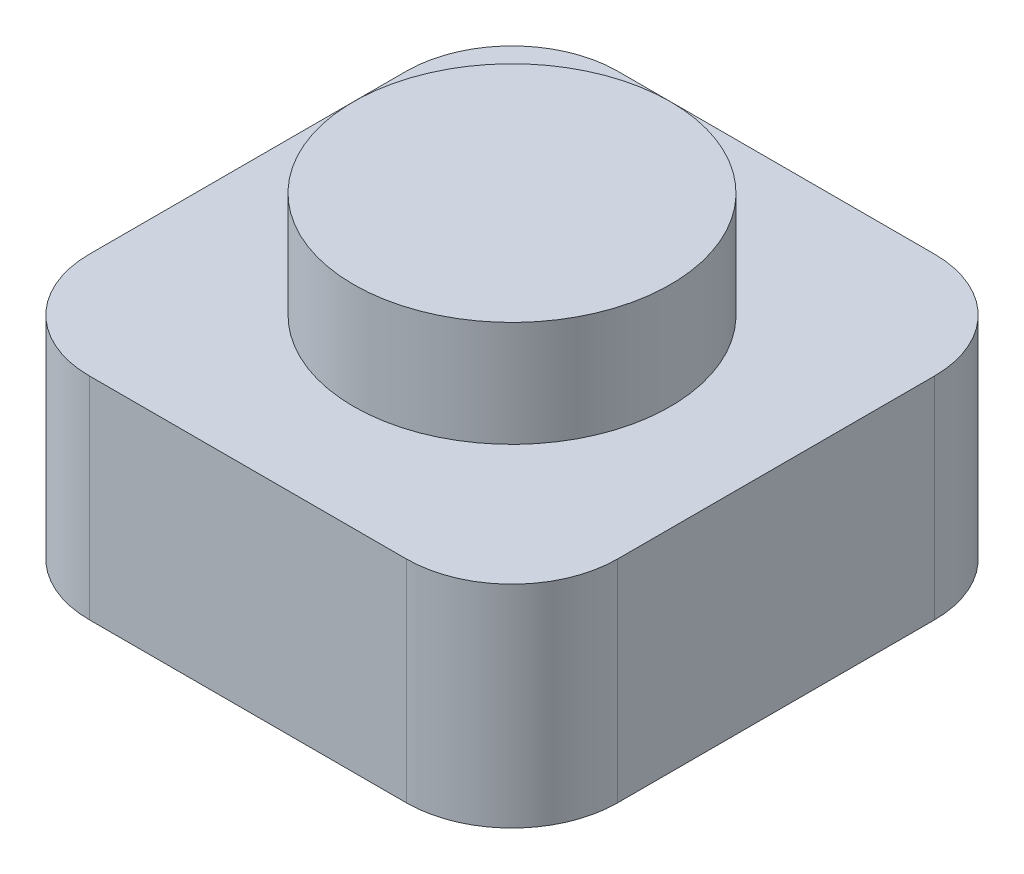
ISO-10303-21;
HEADER;
FILE_DESCRIPTION(('STEP AP214'),'2;1');
FILE_NAME('part.step','',(''),(''),'','','');
FILE_SCHEMA(('AUTOMOTIVE_DESIGN { 1 0 10303 214 1 1 1 1 }'));
ENDSEC;
DATA;
#1=APPLICATION_CONTEXT('core data for automotive mechanical design processes');
#2=APPLICATION_PROTOCOL_DEFINITION('international standard','automotive_design',2000,#1);
#3=PRODUCT_CONTEXT('',#1,'mechanical');
#4=PRODUCT('Part','Part','',(#3));
#5=PRODUCT_RELATED_PRODUCT_CATEGORY('part','',(#4));
#6=PRODUCT_DEFINITION_FORMATION('','',#4);
#7=PRODUCT_DEFINITION_CONTEXT('part definition',#1,'design');
#8=PRODUCT_DEFINITION('design','',#6,#7);
#9=PRODUCT_DEFINITION_SHAPE('','',#8);
#10=(LENGTH_UNIT() NAMED_UNIT(*) SI_UNIT(.MILLI.,.METRE.));
#11=(NAMED_UNIT(*) PLANE_ANGLE_UNIT() SI_UNIT($,.RADIAN.));
#12=(NAMED_UNIT(*) SI_UNIT($,.STERADIAN.) SOLID_ANGLE_UNIT());
#13=UNCERTAINTY_MEASURE_WITH_UNIT(LENGTH_MEASURE(1.E-05),#10,'distance_accuracy_value','');
#14=(GEOMETRIC_REPRESENTATION_CONTEXT(3) GLOBAL_UNCERTAINTY_ASSIGNED_CONTEXT((#13)) GLOBAL_UNIT_ASSIGNED_CONTEXT((#10,
#11,#12)) REPRESENTATION_CONTEXT('',''));
#15=CARTESIAN_POINT('',(0.,0.,0.));
#16=DIRECTION('',(0.,0.,1.));
#17=DIRECTION('',(1.,0.,0.));
#18=AXIS2_PLACEMENT_3D('',#15,#16,#17);
#19=CARTESIAN_POINT('',(2.00826446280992,4.,-1.24380165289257));
#20=DIRECTION('',(0.,-1.,0.));
#21=DIRECTION('',(0.,0.,-1.));
#22=AXIS2_PLACEMENT_3D('',#19,#20,#21);
#23=CYLINDRICAL_SURFACE('',#22,2.);
#24=CARTESIAN_POINT('',(2.00826446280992,0.,-1.24380165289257));
#25=DIRECTION('',(0.,1.,0.));
#26=DIRECTION('',(0.,0.,1.));
#27=AXIS2_PLACEMENT_3D('',#24,#25,#26);
#28=CIRCLE('',#27,2.);
#29=CARTESIAN_POINT('',(4.00826446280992,0.,-1.24380165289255));
#30=VERTEX_POINT('',#29);
#31=CARTESIAN_POINT('',(2.0082644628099,0.,-3.24380165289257));
#32=VERTEX_POINT('',#31);
#33=EDGE_CURVE('E139',#30,#32,#28,.T.);
#34=ORIENTED_EDGE('',*,*,#33,.T.);
#35=DIRECTION('',(0.,-1.,0.));
#36=VECTOR('',#35,1.);
#37=CARTESIAN_POINT('',(2.0082644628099,4.,-3.24380165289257));
#38=LINE('',#37,#36);
#39=CARTESIAN_POINT('',(2.0082644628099,4.,-3.24380165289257));
#40=VERTEX_POINT('',#39);
#41=EDGE_CURVE('E44',#40,#32,#38,.T.);
#42=ORIENTED_EDGE('',*,*,#41,.F.);
#43=CARTESIAN_POINT('',(2.00826446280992,4.,-1.24380165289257));
#44=DIRECTION('',(0.,1.,0.));
#45=DIRECTION('',(0.,0.,1.));
#46=AXIS2_PLACEMENT_3D('',#43,#44,#45);
#47=CIRCLE('',#46,2.);
#48=CARTESIAN_POINT('',(4.00826446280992,4.,-1.24380165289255));
#49=VERTEX_POINT('',#48);
#50=EDGE_CURVE('E154',#49,#40,#47,.T.);
#51=ORIENTED_EDGE('',*,*,#50,.F.);
#52=DIRECTION('',(0.,-1.,0.));
#53=VECTOR('',#52,1.);
#54=CARTESIAN_POINT('',(4.00826446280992,4.,-1.24380165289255));
#55=LINE('',#54,#53);
#56=EDGE_CURVE('E135',#49,#30,#55,.T.);
#57=ORIENTED_EDGE('',*,*,#56,.T.);
#58=EDGE_LOOP('',(#34,#42,#51,#57));
#59=FACE_BOUND('',#58,.T.);
#60=ADVANCED_FACE('F41',(#59),#23,.T.);
#61=CARTESIAN_POINT('',(-3.99173553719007,4.,-3.24380165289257));
#62=DIRECTION('',(0.,0.,1.));
#63=DIRECTION('',(1.,0.,0.));
#64=AXIS2_PLACEMENT_3D('',#61,#62,#63);
#65=PLANE('',#64);
#66=DIRECTION('',(-1.,0.,0.));
#67=VECTOR('',#66,1.);
#68=CARTESIAN_POINT('',(-3.99173553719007,0.,-3.24380165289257));
#69=LINE('',#68,#67);
#70=CARTESIAN_POINT('',(-3.99173553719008,0.,-3.24380165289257));
#71=VERTEX_POINT('',#70);
#72=EDGE_CURVE('E142',#32,#71,#69,.T.);
#73=ORIENTED_EDGE('',*,*,#72,.T.);
#74=DIRECTION('',(0.,-1.,0.));
#75=VECTOR('',#74,1.);
#76=CARTESIAN_POINT('',(-3.99173553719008,4.,-3.24380165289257));
#77=LINE('',#76,#75);
#78=CARTESIAN_POINT('',(-3.99173553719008,4.,-3.24380165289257));
#79=VERTEX_POINT('',#78);
#80=EDGE_CURVE('E163',#79,#71,#77,.T.);
#81=ORIENTED_EDGE('',*,*,#80,.F.);
#82=DIRECTION('',(-1.,0.,0.));
#83=VECTOR('',#82,1.);
#84=CARTESIAN_POINT('',(-3.99173553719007,4.,-3.24380165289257));
#85=LINE('',#84,#83);
#86=EDGE_CURVE('E102',#40,#79,#85,.T.);
#87=ORIENTED_EDGE('',*,*,#86,.F.);
#88=ORIENTED_EDGE('',*,*,#41,.T.);
#89=EDGE_LOOP('',(#73,#81,#87,#88));
#90=FACE_BOUND('',#89,.T.);
#91=ADVANCED_FACE('F169',(#90),#65,.F.);
#92=CARTESIAN_POINT('',(-3.99173553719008,4.,-1.24380165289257));
#93=DIRECTION('',(0.,-1.,0.));
#94=DIRECTION('',(0.,0.,-1.));
#95=AXIS2_PLACEMENT_3D('',#92,#93,#94);
#96=CYLINDRICAL_SURFACE('',#95,2.);
#97=CARTESIAN_POINT('',(-3.99173553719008,0.,-1.24380165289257));
#98=DIRECTION('',(0.,1.,0.));
#99=DIRECTION('',(0.,0.,-1.));
#100=AXIS2_PLACEMENT_3D('',#97,#98,#99);
#101=CIRCLE('',#100,2.);
#102=CARTESIAN_POINT('',(-5.99173553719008,0.,-1.24380165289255));
#103=VERTEX_POINT('',#102);
#104=EDGE_CURVE('E145',#71,#103,#101,.T.);
#105=ORIENTED_EDGE('',*,*,#104,.T.);
#106=DIRECTION('',(0.,-1.,0.));
#107=VECTOR('',#106,1.);
#108=CARTESIAN_POINT('',(-5.99173553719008,4.,-1.24380165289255));
#109=LINE('',#108,#107);
#110=CARTESIAN_POINT('',(-5.99173553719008,4.,-1.24380165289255));
#111=VERTEX_POINT('',#110);
#112=EDGE_CURVE('E161',#111,#103,#109,.T.);
#113=ORIENTED_EDGE('',*,*,#112,.F.);
#114=CARTESIAN_POINT('',(-3.99173553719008,4.,-1.24380165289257));
#115=DIRECTION('',(0.,1.,0.));
#116=DIRECTION('',(0.,0.,-1.));
#117=AXIS2_PLACEMENT_3D('',#114,#115,#116);
#118=CIRCLE('',#117,2.);
#119=EDGE_CURVE('E184',#79,#111,#118,.T.);
#120=ORIENTED_EDGE('',*,*,#119,.F.);
#121=ORIENTED_EDGE('',*,*,#80,.T.);
#122=EDGE_LOOP('',(#105,#113,#120,#121));
#123=FACE_BOUND('',#122,.T.);
#124=ADVANCED_FACE('F178',(#123),#96,.T.);
#125=CARTESIAN_POINT('',(-5.99173553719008,4.,4.75619834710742));
#126=DIRECTION('',(1.,0.,0.));
#127=DIRECTION('',(0.,0.,-1.));
#128=AXIS2_PLACEMENT_3D('',#125,#126,#127);
#129=PLANE('',#128);
#130=DIRECTION('',(0.,0.,1.));
#131=VECTOR('',#130,1.);
#132=CARTESIAN_POINT('',(-5.99173553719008,0.,4.75619834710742));
#133=LINE('',#132,#131);
#134=CARTESIAN_POINT('',(-5.99173553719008,0.,4.75619834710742));
#135=VERTEX_POINT('',#134);
#136=EDGE_CURVE('E147',#103,#135,#133,.T.);
#137=ORIENTED_EDGE('',*,*,#136,.T.);
#138=DIRECTION('',(0.,-1.,0.));
#139=VECTOR('',#138,1.);
#140=CARTESIAN_POINT('',(-5.99173553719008,4.,4.75619834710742));
#141=LINE('',#140,#139);
#142=CARTESIAN_POINT('',(-5.99173553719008,4.,4.75619834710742));
#143=VERTEX_POINT('',#142);
#144=EDGE_CURVE('E158',#143,#135,#141,.T.);
#145=ORIENTED_EDGE('',*,*,#144,.F.);
#146=DIRECTION('',(0.,0.,1.));
#147=VECTOR('',#146,1.);
#148=CARTESIAN_POINT('',(-5.99173553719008,4.,4.75619834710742));
#149=LINE('',#148,#147);
#150=EDGE_CURVE('E183',#111,#143,#149,.T.);
#151=ORIENTED_EDGE('',*,*,#150,.F.);
#152=ORIENTED_EDGE('',*,*,#112,.T.);
#153=EDGE_LOOP('',(#137,#145,#151,#152));
#154=FACE_BOUND('',#153,.T.);
#155=ADVANCED_FACE('F181',(#154),#129,.F.);
#156=CARTESIAN_POINT('',(-3.99173553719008,4.,4.75619834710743));
#157=DIRECTION('',(0.,-1.,0.));
#158=DIRECTION('',(0.,0.,-1.));
#159=AXIS2_PLACEMENT_3D('',#156,#157,#158);
#160=CYLINDRICAL_SURFACE('',#159,2.);
#161=CARTESIAN_POINT('',(-3.99173553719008,0.,4.75619834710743));
#162=DIRECTION('',(0.,1.,0.));
#163=DIRECTION('',(0.,0.,1.));
#164=AXIS2_PLACEMENT_3D('',#161,#162,#163);
#165=CIRCLE('',#164,2.);
#166=CARTESIAN_POINT('',(-3.99173553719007,0.,6.75619834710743));
#167=VERTEX_POINT('',#166);
#168=EDGE_CURVE('E149',#135,#167,#165,.T.);
#169=ORIENTED_EDGE('',*,*,#168,.T.);
#170=DIRECTION('',(0.,-1.,0.));
#171=VECTOR('',#170,1.);
#172=CARTESIAN_POINT('',(-3.99173553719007,4.,6.75619834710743));
#173=LINE('',#172,#171);
#174=CARTESIAN_POINT('',(-3.99173553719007,4.,6.75619834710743));
#175=VERTEX_POINT('',#174);
#176=EDGE_CURVE('E130',#175,#167,#173,.T.);
#177=ORIENTED_EDGE('',*,*,#176,.F.);
#178=CARTESIAN_POINT('',(-3.99173553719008,4.,4.75619834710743));
#179=DIRECTION('',(0.,1.,0.));
#180=DIRECTION('',(0.,0.,1.));
#181=AXIS2_PLACEMENT_3D('',#178,#179,#180);
#182=CIRCLE('',#181,2.);
#183=EDGE_CURVE('E121',#143,#175,#182,.T.);
#184=ORIENTED_EDGE('',*,*,#183,.F.);
#185=ORIENTED_EDGE('',*,*,#144,.T.);
#186=EDGE_LOOP('',(#169,#177,#184,#185));
#187=FACE_BOUND('',#186,.T.);
#188=ADVANCED_FACE('F221',(#187),#160,.T.);
#189=CARTESIAN_POINT('',(-3.99173553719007,4.,6.75619834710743));
#190=DIRECTION('',(0.,0.,-1.));
#191=DIRECTION('',(-1.,0.,0.));
#192=AXIS2_PLACEMENT_3D('',#189,#190,#191);
#193=PLANE('',#192);
#194=DIRECTION('',(1.,0.,0.));
#195=VECTOR('',#194,1.);
#196=CARTESIAN_POINT('',(-3.99173553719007,0.,6.75619834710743));
#197=LINE('',#196,#195);
#198=CARTESIAN_POINT('',(2.0082644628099,0.,6.75619834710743));
#199=VERTEX_POINT('',#198);
#200=EDGE_CURVE('E129',#167,#199,#197,.T.);
#201=ORIENTED_EDGE('',*,*,#200,.T.);
#202=DIRECTION('',(0.,-1.,0.));
#203=VECTOR('',#202,1.);
#204=CARTESIAN_POINT('',(2.0082644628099,4.,6.75619834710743));
#205=LINE('',#204,#203);
#206=CARTESIAN_POINT('',(2.0082644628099,4.,6.75619834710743));
#207=VERTEX_POINT('',#206);
#208=EDGE_CURVE('E126',#207,#199,#205,.T.);
#209=ORIENTED_EDGE('',*,*,#208,.F.);
#210=DIRECTION('',(1.,0.,0.));
#211=VECTOR('',#210,1.);
#212=CARTESIAN_POINT('',(-3.99173553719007,4.,6.75619834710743));
#213=LINE('',#212,#211);
#214=EDGE_CURVE('E115',#175,#207,#213,.T.);
#215=ORIENTED_EDGE('',*,*,#214,.F.);
#216=ORIENTED_EDGE('',*,*,#176,.T.);
#217=EDGE_LOOP('',(#201,#209,#215,#216));
#218=FACE_BOUND('',#217,.T.);
#219=ADVANCED_FACE('F127',(#218),#193,.F.);
#220=CARTESIAN_POINT('',(2.00826446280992,4.,4.75619834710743));
#221=DIRECTION('',(0.,-1.,0.));
#222=DIRECTION('',(0.,0.,-1.));
#223=AXIS2_PLACEMENT_3D('',#220,#221,#222);
#224=CYLINDRICAL_SURFACE('',#223,2.);
#225=CARTESIAN_POINT('',(2.00826446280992,0.,4.75619834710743));
#226=DIRECTION('',(0.,1.,0.));
#227=DIRECTION('',(0.,0.,1.));
#228=AXIS2_PLACEMENT_3D('',#225,#226,#227);
#229=CIRCLE('',#228,2.);
#230=CARTESIAN_POINT('',(4.00826446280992,0.,4.75619834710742));
#231=VERTEX_POINT('',#230);
#232=EDGE_CURVE('E87',#199,#231,#229,.T.);
#233=ORIENTED_EDGE('',*,*,#232,.T.);
#234=DIRECTION('',(0.,-1.,0.));
#235=VECTOR('',#234,1.);
#236=CARTESIAN_POINT('',(4.00826446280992,4.,4.75619834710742));
#237=LINE('',#236,#235);
#238=CARTESIAN_POINT('',(4.00826446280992,4.,4.75619834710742));
#239=VERTEX_POINT('',#238);
#240=EDGE_CURVE('E131',#239,#231,#237,.T.);
#241=ORIENTED_EDGE('',*,*,#240,.F.);
#242=CARTESIAN_POINT('',(2.00826446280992,4.,4.75619834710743));
#243=DIRECTION('',(0.,1.,0.));
#244=DIRECTION('',(0.,0.,1.));
#245=AXIS2_PLACEMENT_3D('',#242,#243,#244);
#246=CIRCLE('',#245,2.);
#247=EDGE_CURVE('E119',#207,#239,#246,.T.);
#248=ORIENTED_EDGE('',*,*,#247,.F.);
#249=ORIENTED_EDGE('',*,*,#208,.T.);
#250=EDGE_LOOP('',(#233,#241,#248,#249));
#251=FACE_BOUND('',#250,.T.);
#252=ADVANCED_FACE('F133',(#251),#224,.T.);
#253=CARTESIAN_POINT('',(4.00826446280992,4.,4.75619834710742));
#254=DIRECTION('',(-1.,0.,0.));
#255=DIRECTION('',(0.,0.,1.));
#256=AXIS2_PLACEMENT_3D('',#253,#254,#255);
#257=PLANE('',#256);
#258=DIRECTION('',(0.,0.,-1.));
#259=VECTOR('',#258,1.);
#260=CARTESIAN_POINT('',(4.00826446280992,0.,4.75619834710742));
#261=LINE('',#260,#259);
#262=EDGE_CURVE('E93',#231,#30,#261,.T.);
#263=ORIENTED_EDGE('',*,*,#262,.T.);
#264=ORIENTED_EDGE('',*,*,#56,.F.);
#265=DIRECTION('',(0.,0.,-1.));
#266=VECTOR('',#265,1.);
#267=CARTESIAN_POINT('',(4.00826446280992,4.,4.75619834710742));
#268=LINE('',#267,#266);
#269=EDGE_CURVE('E58',#239,#49,#268,.T.);
#270=ORIENTED_EDGE('',*,*,#269,.F.);
#271=ORIENTED_EDGE('',*,*,#240,.T.);
#272=EDGE_LOOP('',(#263,#264,#270,#271));
#273=FACE_BOUND('',#272,.T.);
#274=ADVANCED_FACE('F202',(#273),#257,.F.);
#275=CARTESIAN_POINT('',(2.00826446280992,4.,-1.24380165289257));
#276=DIRECTION('',(0.,1.,0.));
#277=DIRECTION('',(0.,0.,1.));
#278=AXIS2_PLACEMENT_3D('',#275,#276,#277);
#279=PLANE('',#278);
#280=CARTESIAN_POINT('',(-0.991735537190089,4.,1.75619834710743));
#281=DIRECTION('',(0.,1.,0.));
#282=DIRECTION('',(0.,0.,1.));
#283=AXIS2_PLACEMENT_3D('',#280,#281,#282);
#284=CIRCLE('',#283,3.);
#285=CARTESIAN_POINT('',(-0.991735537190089,4.,4.75619834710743));
#286=VERTEX_POINT('',#285);
#287=EDGE_CURVE('E11',#286,#286,#284,.T.);
#288=ORIENTED_EDGE('',*,*,#287,.F.);
#289=EDGE_LOOP('',(#288));
#290=FACE_BOUND('',#289,.T.);
#291=ORIENTED_EDGE('',*,*,#50,.T.);
#292=ORIENTED_EDGE('',*,*,#86,.T.);
#293=ORIENTED_EDGE('',*,*,#119,.T.);
#294=ORIENTED_EDGE('',*,*,#150,.T.);
#295=ORIENTED_EDGE('',*,*,#183,.T.);
#296=ORIENTED_EDGE('',*,*,#214,.T.);
#297=ORIENTED_EDGE('',*,*,#247,.T.);
#298=ORIENTED_EDGE('',*,*,#269,.T.);
#299=EDGE_LOOP('',(#291,#292,#293,#294,#295,#296,#297,#298));
#300=FACE_BOUND('',#299,.T.);
#301=ADVANCED_FACE('F117',(#290,#300),#279,.T.);
#302=CARTESIAN_POINT('',(2.00826446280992,0.,-1.24380165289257));
#303=DIRECTION('',(0.,1.,0.));
#304=DIRECTION('',(0.,0.,1.));
#305=AXIS2_PLACEMENT_3D('',#302,#303,#304);
#306=PLANE('',#305);
#307=ORIENTED_EDGE('',*,*,#33,.F.);
#308=ORIENTED_EDGE('',*,*,#262,.F.);
#309=ORIENTED_EDGE('',*,*,#232,.F.);
#310=ORIENTED_EDGE('',*,*,#200,.F.);
#311=ORIENTED_EDGE('',*,*,#168,.F.);
#312=ORIENTED_EDGE('',*,*,#136,.F.);
#313=ORIENTED_EDGE('',*,*,#104,.F.);
#314=ORIENTED_EDGE('',*,*,#72,.F.);
#315=EDGE_LOOP('',(#307,#308,#309,#310,#311,#312,#313,#314));
#316=FACE_BOUND('',#315,.T.);
#317=ADVANCED_FACE('F174',(#316),#306,.F.);
#318=CARTESIAN_POINT('',(-0.991735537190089,6.,1.75619834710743));
#319=DIRECTION('',(0.,-1.,0.));
#320=DIRECTION('',(0.,0.,-1.));
#321=AXIS2_PLACEMENT_3D('',#318,#319,#320);
#322=CYLINDRICAL_SURFACE('',#321,3.);
#323=CARTESIAN_POINT('',(-0.991735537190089,6.,1.75619834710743));
#324=DIRECTION('',(0.,1.,0.));
#325=DIRECTION('',(0.,0.,1.));
#326=AXIS2_PLACEMENT_3D('',#323,#324,#325);
#327=CIRCLE('',#326,3.);
#328=CARTESIAN_POINT('',(-0.991735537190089,6.,4.75619834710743));
#329=VERTEX_POINT('',#328);
#330=EDGE_CURVE('E143',#329,#329,#327,.T.);
#331=ORIENTED_EDGE('',*,*,#330,.F.);
#332=EDGE_LOOP('',(#331));
#333=FACE_BOUND('',#332,.T.);
#334=ORIENTED_EDGE('',*,*,#287,.T.);
#335=EDGE_LOOP('',(#334));
#336=FACE_BOUND('',#335,.T.);
#337=ADVANCED_FACE('F195',(#333,#336),#322,.T.);
#338=CARTESIAN_POINT('',(-0.991735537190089,6.,1.75619834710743));
#339=DIRECTION('',(0.,1.,0.));
#340=DIRECTION('',(0.,0.,1.));
#341=AXIS2_PLACEMENT_3D('',#338,#339,#340);
#342=PLANE('',#341);
#343=ORIENTED_EDGE('',*,*,#330,.T.);
#344=EDGE_LOOP('',(#343));
#345=FACE_BOUND('',#344,.T.);
#346=ADVANCED_FACE('F193',(#345),#342,.T.);
#347=CLOSED_SHELL('',(#60,#91,#124,#155,#188,#219,#252,#274,#301,#317,#337,#346));
#348=MANIFOLD_SOLID_BREP('B2',#347);
#349=ADVANCED_BREP_SHAPE_REPRESENTATION('',(#18,#348),#14);
#350=SHAPE_DEFINITION_REPRESENTATION(#9,#349);
ENDSEC;
END-ISO-10303-21;
